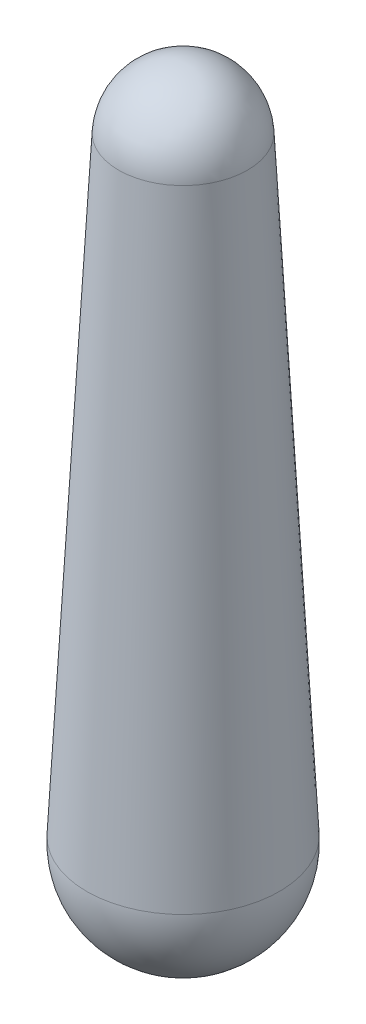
from build123d import *


with BuildPart() as part:
    # Skizze1 → Rotation1 (revolve)
    with BuildSketch(Plane.XY, mode=Mode.PRIVATE) as rotation1_sk:
        with BuildLine():
            Line((3.338629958, 36.831758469), (4.993147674, 5.261679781))
            ThreePointArc((4.993147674, 5.261679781), (3.626871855, 1.558227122), (0, 0))
            Line((0, 0), (0, 40))
            ThreePointArc((0, 40), (2.30131508, 39.08186838), (3.338629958, 36.831758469))
        make_face()
    revolve(rotation1_sk.sketch.rotate(Axis((0, 0, 0), (0, -1, 0)), 90), axis=Axis((0, 0, 0), (0, -1, 0)))


solid = part.part
